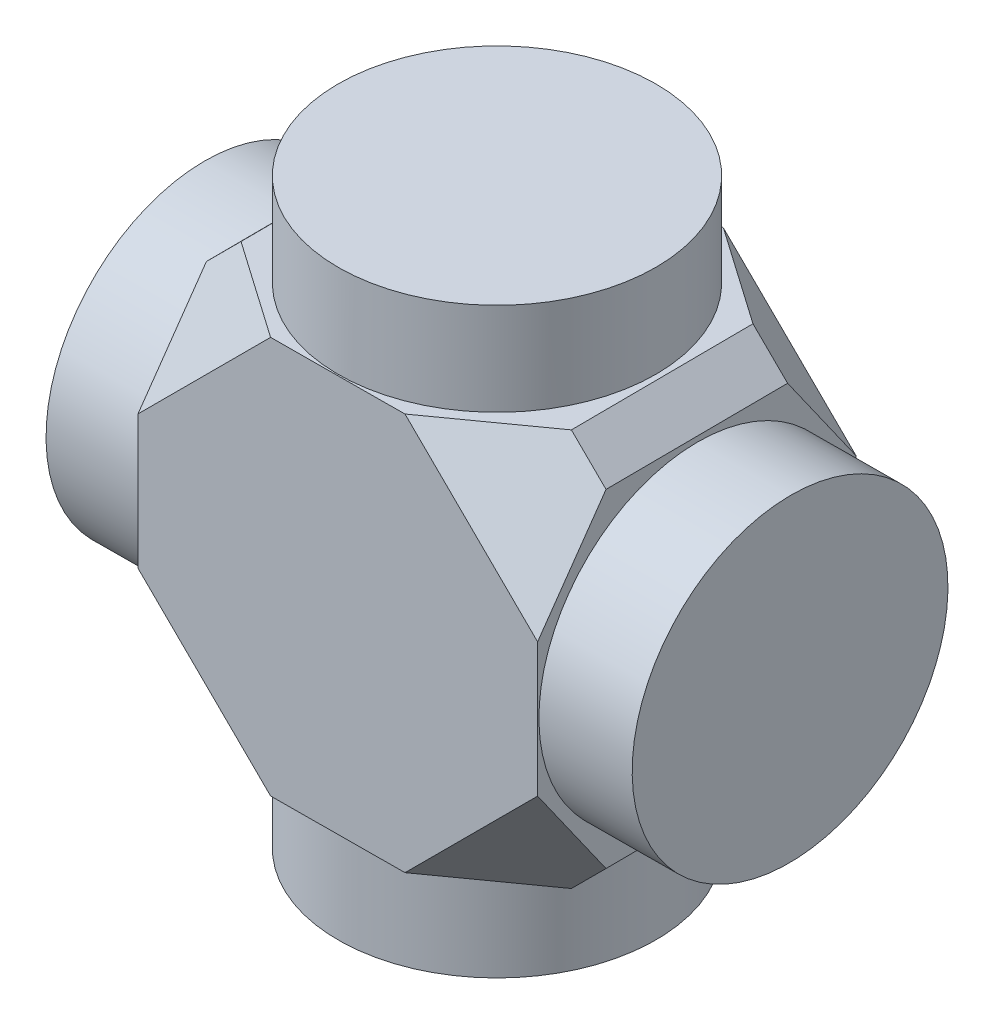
ISO-10303-21;
HEADER;
FILE_DESCRIPTION(('STEP AP214'),'2;1');
FILE_NAME('part.step','',(''),(''),'','','');
FILE_SCHEMA(('AUTOMOTIVE_DESIGN { 1 0 10303 214 1 1 1 1 }'));
ENDSEC;
DATA;
#1=APPLICATION_CONTEXT('core data for automotive mechanical design processes');
#2=APPLICATION_PROTOCOL_DEFINITION('international standard','automotive_design',2000,#1);
#3=PRODUCT_CONTEXT('',#1,'mechanical');
#4=PRODUCT('Part','Part','',(#3));
#5=PRODUCT_RELATED_PRODUCT_CATEGORY('part','',(#4));
#6=PRODUCT_DEFINITION_FORMATION('','',#4);
#7=PRODUCT_DEFINITION_CONTEXT('part definition',#1,'design');
#8=PRODUCT_DEFINITION('design','',#6,#7);
#9=PRODUCT_DEFINITION_SHAPE('','',#8);
#10=(LENGTH_UNIT() NAMED_UNIT(*) SI_UNIT(.MILLI.,.METRE.));
#11=(NAMED_UNIT(*) PLANE_ANGLE_UNIT() SI_UNIT($,.RADIAN.));
#12=(NAMED_UNIT(*) SI_UNIT($,.STERADIAN.) SOLID_ANGLE_UNIT());
#13=UNCERTAINTY_MEASURE_WITH_UNIT(LENGTH_MEASURE(1.E-05),#10,'distance_accuracy_value','');
#14=(GEOMETRIC_REPRESENTATION_CONTEXT(3) GLOBAL_UNCERTAINTY_ASSIGNED_CONTEXT((#13)) GLOBAL_UNIT_ASSIGNED_CONTEXT((#10,
#11,#12)) REPRESENTATION_CONTEXT('',''));
#15=CARTESIAN_POINT('',(0.,0.,0.));
#16=DIRECTION('',(0.,0.,1.));
#17=DIRECTION('',(1.,0.,0.));
#18=AXIS2_PLACEMENT_3D('',#15,#16,#17);
#19=CARTESIAN_POINT('',(-75.000000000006,10.9999999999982,-148.379999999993));
#20=DIRECTION('',(0.,-1.,0.));
#21=DIRECTION('',(0.999980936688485,0.,-0.00617464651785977));
#22=AXIS2_PLACEMENT_3D('',#19,#20,#21);
#23=CYLINDRICAL_SURFACE('',#22,6.);
#24=CARTESIAN_POINT('',(-75.000000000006,10.9999999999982,-148.379999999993));
#25=DIRECTION('',(0.,1.,0.));
#26=DIRECTION('',(-0.999980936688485,0.,0.00617464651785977));
#27=AXIS2_PLACEMENT_3D('',#24,#25,#26);
#28=CIRCLE('',#27,6.);
#29=CARTESIAN_POINT('',(-80.9998856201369,10.9999999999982,-148.342952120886));
#30=VERTEX_POINT('',#29);
#31=EDGE_CURVE('E264',#30,#30,#28,.T.);
#32=ORIENTED_EDGE('',*,*,#31,.F.);
#33=EDGE_LOOP('',(#32));
#34=FACE_BOUND('',#33,.T.);
#35=CARTESIAN_POINT('',(-75.000000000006,7.49999999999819,-148.379999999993));
#36=DIRECTION('',(0.,-1.,0.));
#37=DIRECTION('',(0.999980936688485,0.,-0.00617464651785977));
#38=AXIS2_PLACEMENT_3D('',#35,#36,#37);
#39=CIRCLE('',#38,6.);
#40=CARTESIAN_POINT('',(-69.0001143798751,7.49999999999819,-148.4170478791));
#41=VERTEX_POINT('',#40);
#42=EDGE_CURVE('E20',#41,#41,#39,.F.);
#43=ORIENTED_EDGE('',*,*,#42,.T.);
#44=EDGE_LOOP('',(#43));
#45=FACE_BOUND('',#44,.T.);
#46=ADVANCED_FACE('F16',(#34,#45),#23,.T.);
#47=CARTESIAN_POINT('',(-75.000000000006,10.9999999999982,-148.379999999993));
#48=DIRECTION('',(0.,1.,0.));
#49=DIRECTION('',(-0.999980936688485,0.,0.00617464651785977));
#50=AXIS2_PLACEMENT_3D('',#47,#48,#49);
#51=PLANE('',#50);
#52=ORIENTED_EDGE('',*,*,#31,.T.);
#53=EDGE_LOOP('',(#52));
#54=FACE_BOUND('',#53,.T.);
#55=ADVANCED_FACE('F344',(#54),#51,.T.);
#56=CARTESIAN_POINT('',(-64.0002096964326,-1.81256351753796E-12,-148.44792111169));
#57=DIRECTION('',(0.999980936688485,0.,-0.00617464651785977));
#58=DIRECTION('',(0.,1.,0.));
#59=AXIS2_PLACEMENT_3D('',#56,#57,#58);
#60=PLANE('',#59);
#61=CARTESIAN_POINT('',(-64.0002096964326,-1.81256351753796E-12,-148.44792111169));
#62=DIRECTION('',(0.999980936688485,0.,-0.00617464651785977));
#63=DIRECTION('',(0.,1.,0.));
#64=AXIS2_PLACEMENT_3D('',#61,#62,#63);
#65=CIRCLE('',#64,6.);
#66=CARTESIAN_POINT('',(-64.0002096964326,5.99999999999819,-148.44792111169));
#67=VERTEX_POINT('',#66);
#68=EDGE_CURVE('E252',#67,#67,#65,.T.);
#69=ORIENTED_EDGE('',*,*,#68,.T.);
#70=EDGE_LOOP('',(#69));
#71=FACE_BOUND('',#70,.T.);
#72=ADVANCED_FACE('F352',(#71),#60,.T.);
#73=CARTESIAN_POINT('',(-85.9997903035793,-1.81444636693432E-12,-148.312078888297));
#74=DIRECTION('',(0.999980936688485,0.,-0.00617464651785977));
#75=DIRECTION('',(0.,1.,0.));
#76=AXIS2_PLACEMENT_3D('',#73,#74,#75);
#77=PLANE('',#76);
#78=CARTESIAN_POINT('',(-85.9997903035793,-1.81444636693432E-12,-148.312078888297));
#79=DIRECTION('',(0.999980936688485,0.,-0.00617464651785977));
#80=DIRECTION('',(0.,1.,0.));
#81=AXIS2_PLACEMENT_3D('',#78,#79,#80);
#82=CIRCLE('',#81,6.);
#83=CARTESIAN_POINT('',(-85.9997903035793,5.99999999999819,-148.312078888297));
#84=VERTEX_POINT('',#83);
#85=EDGE_CURVE('E259',#84,#84,#82,.T.);
#86=ORIENTED_EDGE('',*,*,#85,.F.);
#87=EDGE_LOOP('',(#86));
#88=FACE_BOUND('',#87,.T.);
#89=ADVANCED_FACE('F514',(#88),#77,.F.);
#90=CARTESIAN_POINT('',(-64.0002096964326,-1.81256351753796E-12,-148.44792111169));
#91=DIRECTION('',(-0.999980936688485,0.,0.00617464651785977));
#92=DIRECTION('',(0.,-1.,0.));
#93=AXIS2_PLACEMENT_3D('',#90,#91,#92);
#94=CYLINDRICAL_SURFACE('',#93,6.);
#95=CARTESIAN_POINT('',(-67.5001429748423,-1.81286306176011E-12,-148.426309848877));
#96=DIRECTION('',(0.999980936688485,0.,-0.00617464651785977));
#97=DIRECTION('',(0.,1.,0.));
#98=AXIS2_PLACEMENT_3D('',#95,#96,#97);
#99=CIRCLE('',#98,6.);
#100=CARTESIAN_POINT('',(-67.5001429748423,5.99999999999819,-148.426309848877));
#101=VERTEX_POINT('',#100);
#102=EDGE_CURVE('E249',#101,#101,#99,.F.);
#103=ORIENTED_EDGE('',*,*,#102,.F.);
#104=EDGE_LOOP('',(#103));
#105=FACE_BOUND('',#104,.T.);
#106=ORIENTED_EDGE('',*,*,#68,.F.);
#107=EDGE_LOOP('',(#106));
#108=FACE_BOUND('',#107,.T.);
#109=ADVANCED_FACE('F520',(#105,#108),#94,.T.);
#110=ORIENTED_EDGE('',*,*,#85,.T.);
#111=EDGE_LOOP('',(#110));
#112=FACE_BOUND('',#111,.T.);
#113=CARTESIAN_POINT('',(-82.4998570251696,-1.81414682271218E-12,-148.333690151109));
#114=DIRECTION('',(0.999980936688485,0.,-0.00617464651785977));
#115=DIRECTION('',(0.,1.,0.));
#116=AXIS2_PLACEMENT_3D('',#113,#114,#115);
#117=CIRCLE('',#116,6.);
#118=CARTESIAN_POINT('',(-82.4998570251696,5.99999999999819,-148.333690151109));
#119=VERTEX_POINT('',#118);
#120=EDGE_CURVE('E248',#119,#119,#117,.F.);
#121=ORIENTED_EDGE('',*,*,#120,.T.);
#122=EDGE_LOOP('',(#121));
#123=FACE_BOUND('',#122,.T.);
#124=ADVANCED_FACE('F529',(#112,#123),#94,.T.);
#125=CARTESIAN_POINT('',(-67.4627863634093,-7.50000000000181,-142.376425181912));
#126=DIRECTION('',(0.999980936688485,0.,-0.00617464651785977));
#127=DIRECTION('',(0.,1.,0.));
#128=AXIS2_PLACEMENT_3D('',#125,#126,#127);
#129=PLANE('',#128);
#130=ORIENTED_EDGE('',*,*,#102,.T.);
#131=EDGE_LOOP('',(#130));
#132=FACE_BOUND('',#131,.T.);
#133=DIRECTION('',(-0.00617464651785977,0.,-0.999980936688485));
#134=VECTOR('',#133,1.);
#135=CARTESIAN_POINT('',(-67.5374995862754,-6.20000000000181,-154.476194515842));
#136=LINE('',#135,#134);
#137=CARTESIAN_POINT('',(-67.4788404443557,-6.20000000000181,-144.976375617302));
#138=VERTEX_POINT('',#137);
#139=CARTESIAN_POINT('',(-67.5214455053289,-6.20000000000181,-151.876244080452));
#140=VERTEX_POINT('',#139);
#141=EDGE_CURVE('E182',#138,#140,#136,.T.);
#142=ORIENTED_EDGE('',*,*,#141,.T.);
#143=DIRECTION('',(-0.0035649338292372,0.816496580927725,-0.577339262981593));
#144=VECTOR('',#143,1.);
#145=CARTESIAN_POINT('',(-67.4981084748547,-11.5450096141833,-148.096823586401));
#146=LINE('',#145,#144);
#147=CARTESIAN_POINT('',(-67.5374995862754,-2.52304473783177,-154.476194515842));
#148=VERTEX_POINT('',#147);
#149=EDGE_CURVE('E232',#140,#148,#146,.T.);
#150=ORIENTED_EDGE('',*,*,#149,.T.);
#151=DIRECTION('',(0.,1.,0.));
#152=VECTOR('',#151,1.);
#153=CARTESIAN_POINT('',(-67.5374995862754,-7.50000000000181,-154.476194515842));
#154=LINE('',#153,#152);
#155=CARTESIAN_POINT('',(-67.5374995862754,2.52304473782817,-154.476194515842));
#156=VERTEX_POINT('',#155);
#157=EDGE_CURVE('E153',#148,#156,#154,.T.);
#158=ORIENTED_EDGE('',*,*,#157,.T.);
#159=DIRECTION('',(0.00356493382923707,0.816496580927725,0.577339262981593));
#160=VECTOR('',#159,1.);
#161=CARTESIAN_POINT('',(-67.5417698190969,1.54500961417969,-155.167756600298));
#162=LINE('',#161,#160);
#163=CARTESIAN_POINT('',(-67.5214455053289,6.19999999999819,-151.876244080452));
#164=VERTEX_POINT('',#163);
#165=EDGE_CURVE('E39',#156,#164,#162,.T.);
#166=ORIENTED_EDGE('',*,*,#165,.T.);
#167=DIRECTION('',(0.00617464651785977,0.,0.999980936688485));
#168=VECTOR('',#167,1.);
#169=CARTESIAN_POINT('',(-67.4627863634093,6.19999999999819,-142.376425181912));
#170=LINE('',#169,#168);
#171=CARTESIAN_POINT('',(-67.4788404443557,6.19999999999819,-144.976375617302));
#172=VERTEX_POINT('',#171);
#173=EDGE_CURVE('E180',#164,#172,#170,.T.);
#174=ORIENTED_EDGE('',*,*,#173,.T.);
#175=DIRECTION('',(0.00356493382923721,-0.816496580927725,0.577339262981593));
#176=VECTOR('',#175,1.);
#177=CARTESIAN_POINT('',(-67.4336117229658,-4.15898508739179,-137.651606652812));
#178=LINE('',#177,#176);
#179=CARTESIAN_POINT('',(-67.4627863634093,2.52304473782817,-142.376425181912));
#180=VERTEX_POINT('',#179);
#181=EDGE_CURVE('E227',#172,#180,#178,.T.);
#182=ORIENTED_EDGE('',*,*,#181,.T.);
#183=DIRECTION('',(0.,-1.,0.));
#184=VECTOR('',#183,1.);
#185=CARTESIAN_POINT('',(-67.4627863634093,7.49999999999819,-142.376425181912));
#186=LINE('',#185,#184);
#187=CARTESIAN_POINT('',(-67.4627863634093,-2.52304473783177,-142.376425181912));
#188=VERTEX_POINT('',#187);
#189=EDGE_CURVE('E271',#180,#188,#186,.T.);
#190=ORIENTED_EDGE('',*,*,#189,.T.);
#191=DIRECTION('',(-0.00356493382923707,-0.816496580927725,-0.577339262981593));
#192=VECTOR('',#191,1.);
#193=CARTESIAN_POINT('',(-67.4772730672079,-5.84101491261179,-144.72253966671));
#194=LINE('',#193,#192);
#195=EDGE_CURVE('E229',#188,#138,#194,.T.);
#196=ORIENTED_EDGE('',*,*,#195,.T.);
#197=EDGE_LOOP('',(#142,#150,#158,#166,#174,#182,#190,#196));
#198=FACE_BOUND('',#197,.T.);
#199=ADVANCED_FACE('F318',(#132,#198),#129,.T.);
#200=CARTESIAN_POINT('',(-82.4625004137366,-7.50000000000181,-142.283805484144));
#201=DIRECTION('',(0.999980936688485,0.,-0.00617464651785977));
#202=DIRECTION('',(0.,1.,0.));
#203=AXIS2_PLACEMENT_3D('',#200,#201,#202);
#204=PLANE('',#203);
#205=ORIENTED_EDGE('',*,*,#120,.F.);
#206=EDGE_LOOP('',(#205));
#207=FACE_BOUND('',#206,.T.);
#208=DIRECTION('',(-0.00617464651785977,0.,-0.999980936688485));
#209=VECTOR('',#208,1.);
#210=CARTESIAN_POINT('',(-82.4625004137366,6.19999999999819,-142.283805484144));
#211=LINE('',#210,#209);
#212=CARTESIAN_POINT('',(-82.478554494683,6.19999999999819,-144.883755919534));
#213=VERTEX_POINT('',#212);
#214=CARTESIAN_POINT('',(-82.5211595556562,6.19999999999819,-151.783624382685));
#215=VERTEX_POINT('',#214);
#216=EDGE_CURVE('E174',#213,#215,#211,.T.);
#217=ORIENTED_EDGE('',*,*,#216,.T.);
#218=DIRECTION('',(0.00356493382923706,0.816496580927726,0.577339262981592));
#219=VECTOR('',#218,1.);
#220=CARTESIAN_POINT('',(-82.5299702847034,4.18202982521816,-153.210517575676));
#221=LINE('',#220,#219);
#222=CARTESIAN_POINT('',(-82.5372136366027,2.52304473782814,-154.383574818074));
#223=VERTEX_POINT('',#222);
#224=EDGE_CURVE('E214',#215,#223,#221,.F.);
#225=ORIENTED_EDGE('',*,*,#224,.T.);
#226=DIRECTION('',(0.,1.,0.));
#227=VECTOR('',#226,1.);
#228=CARTESIAN_POINT('',(-82.5372136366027,-7.50000000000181,-154.383574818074));
#229=LINE('',#228,#227);
#230=CARTESIAN_POINT('',(-82.5372136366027,-2.52304473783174,-154.383574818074));
#231=VERTEX_POINT('',#230);
#232=EDGE_CURVE('E256',#231,#223,#229,.T.);
#233=ORIENTED_EDGE('',*,*,#232,.F.);
#234=DIRECTION('',(-0.0035649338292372,0.816496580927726,-0.577339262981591));
#235=VECTOR('',#234,1.);
#236=CARTESIAN_POINT('',(-82.5081396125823,-9.18202982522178,-149.675051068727));
#237=LINE('',#236,#235);
#238=CARTESIAN_POINT('',(-82.5211595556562,-6.2000000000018,-151.783624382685));
#239=VERTEX_POINT('',#238);
#240=EDGE_CURVE('E212',#231,#239,#237,.F.);
#241=ORIENTED_EDGE('',*,*,#240,.T.);
#242=DIRECTION('',(0.00617464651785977,0.,0.999980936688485));
#243=VECTOR('',#242,1.);
#244=CARTESIAN_POINT('',(-82.4625004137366,-6.2000000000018,-142.283805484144));
#245=LINE('',#244,#243);
#246=CARTESIAN_POINT('',(-82.478554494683,-6.2000000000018,-144.883755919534));
#247=VERTEX_POINT('',#246);
#248=EDGE_CURVE('E177',#239,#247,#245,.T.);
#249=ORIENTED_EDGE('',*,*,#248,.T.);
#250=DIRECTION('',(-0.00356493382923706,-0.816496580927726,-0.577339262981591));
#251=VECTOR('',#250,1.);
#252=CARTESIAN_POINT('',(-82.4697437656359,-4.18202982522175,-143.456862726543));
#253=LINE('',#252,#251);
#254=CARTESIAN_POINT('',(-82.4625004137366,-2.52304473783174,-142.283805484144));
#255=VERTEX_POINT('',#254);
#256=EDGE_CURVE('E210',#247,#255,#253,.F.);
#257=ORIENTED_EDGE('',*,*,#256,.T.);
#258=DIRECTION('',(0.,-1.,0.));
#259=VECTOR('',#258,1.);
#260=CARTESIAN_POINT('',(-82.4625004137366,7.49999999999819,-142.283805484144));
#261=LINE('',#260,#259);
#262=CARTESIAN_POINT('',(-82.4625004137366,2.52304473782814,-142.283805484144));
#263=VERTEX_POINT('',#262);
#264=EDGE_CURVE('E251',#263,#255,#261,.T.);
#265=ORIENTED_EDGE('',*,*,#264,.F.);
#266=DIRECTION('',(0.0035649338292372,-0.816496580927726,0.577339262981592));
#267=VECTOR('',#266,1.);
#268=CARTESIAN_POINT('',(-82.4915744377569,9.18202982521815,-146.992329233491));
#269=LINE('',#268,#267);
#270=EDGE_CURVE('E208',#263,#213,#269,.F.);
#271=ORIENTED_EDGE('',*,*,#270,.T.);
#272=EDGE_LOOP('',(#217,#225,#233,#241,#249,#257,#265,#271));
#273=FACE_BOUND('',#272,.T.);
#274=ADVANCED_FACE('F290',(#207,#273),#204,.F.);
#275=CARTESIAN_POINT('',(-79.9740702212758,-5.01152236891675,-142.299170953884));
#276=DIRECTION('',(0.495624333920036,0.5,-0.710180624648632));
#277=DIRECTION('',(0.707093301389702,-0.70710678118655,-0.00436613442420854));
#278=AXIS2_PLACEMENT_3D('',#275,#276,#277);
#279=PLANE('',#278);
#280=ORIENTED_EDGE('',*,*,#256,.F.);
#281=DIRECTION('',(0.707093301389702,-0.70710678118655,-0.00436613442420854));
#282=VECTOR('',#281,1.);
#283=CARTESIAN_POINT('',(-82.478554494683,-6.2000000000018,-144.883755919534));
#284=LINE('',#283,#282);
#285=CARTESIAN_POINT('',(-81.178579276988,-7.50000000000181,-144.891782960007));
#286=VERTEX_POINT('',#285);
#287=EDGE_CURVE('E216',#286,#247,#284,.F.);
#288=ORIENTED_EDGE('',*,*,#287,.F.);
#289=DIRECTION('',(0.820045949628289,0.,0.572297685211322));
#290=VECTOR('',#289,1.);
#291=CARTESIAN_POINT('',(-79.1518368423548,-7.50000000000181,-143.477350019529));
#292=LINE('',#291,#290);
#293=CARTESIAN_POINT('',(-77.4856400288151,-7.50000000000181,-142.314536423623));
#294=VERTEX_POINT('',#293);
#295=EDGE_CURVE('E220',#294,#286,#292,.F.);
#296=ORIENTED_EDGE('',*,*,#295,.F.);
#297=DIRECTION('',(0.707093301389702,-0.70710678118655,-0.00436613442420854));
#298=VECTOR('',#297,1.);
#299=CARTESIAN_POINT('',(-79.3240826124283,-5.66152236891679,-142.30318447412));
#300=LINE('',#299,#298);
#301=EDGE_CURVE('E243',#255,#294,#300,.T.);
#302=ORIENTED_EDGE('',*,*,#301,.F.);
#303=EDGE_LOOP('',(#280,#288,#296,#302));
#304=FACE_BOUND('',#303,.T.);
#305=ADVANCED_FACE('F311',(#304),#279,.F.);
#306=CARTESIAN_POINT('',(-62.4513595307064,2.48847763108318,-142.407369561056));
#307=DIRECTION('',(0.50435660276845,-0.5,0.704005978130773));
#308=DIRECTION('',(-0.707093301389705,-0.707106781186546,0.00436613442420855));
#309=AXIS2_PLACEMENT_3D('',#306,#307,#308);
#310=PLANE('',#309);
#311=DIRECTION('',(-0.812916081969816,0.,0.58238084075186));
#312=VECTOR('',#311,1.);
#313=CARTESIAN_POINT('',(-65.8098626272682,-7.50000000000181,-147.095334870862));
#314=LINE('',#313,#312);
#315=CARTESIAN_POINT('',(-68.7788156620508,-7.50000000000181,-144.968348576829));
#316=VERTEX_POINT('',#315);
#317=CARTESIAN_POINT('',(-72.4396467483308,-7.50000000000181,-142.345694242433));
#318=VERTEX_POINT('',#317);
#319=EDGE_CURVE('E142',#316,#318,#314,.T.);
#320=ORIENTED_EDGE('',*,*,#319,.F.);
#321=DIRECTION('',(-0.707093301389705,-0.707106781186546,0.00436613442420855));
#322=VECTOR('',#321,1.);
#323=CARTESIAN_POINT('',(-68.7788156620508,-7.50000000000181,-144.968348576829));
#324=LINE('',#323,#322);
#325=EDGE_CURVE('E224',#138,#316,#324,.T.);
#326=ORIENTED_EDGE('',*,*,#325,.F.);
#327=ORIENTED_EDGE('',*,*,#195,.F.);
#328=DIRECTION('',(0.707093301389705,0.707106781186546,-0.00436613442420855));
#329=VECTOR('',#328,1.);
#330=CARTESIAN_POINT('',(-69.3012289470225,-4.36152236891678,-142.365073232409));
#331=LINE('',#330,#329);
#332=EDGE_CURVE('E246',#318,#188,#331,.T.);
#333=ORIENTED_EDGE('',*,*,#332,.F.);
#334=EDGE_LOOP('',(#320,#326,#327,#333));
#335=FACE_BOUND('',#334,.T.);
#336=ADVANCED_FACE('F317',(#335),#310,.T.);
#337=CARTESIAN_POINT('',(-67.4627863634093,-6.20000000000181,-142.376425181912));
#338=DIRECTION('',(0.707093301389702,-0.707106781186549,-0.00436613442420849));
#339=DIRECTION('',(0.00617464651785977,0.,0.999980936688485));
#340=AXIS2_PLACEMENT_3D('',#337,#338,#339);
#341=PLANE('',#340);
#342=DIRECTION('',(0.00617464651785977,0.,0.999980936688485));
#343=VECTOR('',#342,1.);
#344=CARTESIAN_POINT('',(-68.7627615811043,-7.50000000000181,-142.368398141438));
#345=LINE('',#344,#343);
#346=CARTESIAN_POINT('',(-68.821420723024,-7.50000000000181,-151.868217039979));
#347=VERTEX_POINT('',#346);
#348=EDGE_CURVE('E164',#347,#316,#345,.T.);
#349=ORIENTED_EDGE('',*,*,#348,.F.);
#350=DIRECTION('',(0.707093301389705,0.707106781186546,-0.00436613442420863));
#351=VECTOR('',#350,1.);
#352=CARTESIAN_POINT('',(-67.5214455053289,-6.20000000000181,-151.876244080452));
#353=LINE('',#352,#351);
#354=EDGE_CURVE('E136',#347,#140,#353,.T.);
#355=ORIENTED_EDGE('',*,*,#354,.T.);
#356=ORIENTED_EDGE('',*,*,#141,.F.);
#357=ORIENTED_EDGE('',*,*,#325,.T.);
#358=EDGE_LOOP('',(#349,#355,#356,#357));
#359=FACE_BOUND('',#358,.T.);
#360=ADVANCED_FACE('F330',(#359),#341,.T.);
#361=CARTESIAN_POINT('',(-70.0259297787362,-5.01152236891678,-154.460829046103));
#362=DIRECTION('',(0.495624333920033,-0.5,-0.710180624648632));
#363=DIRECTION('',(0.707093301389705,0.707106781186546,-0.00436613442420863));
#364=AXIS2_PLACEMENT_3D('',#361,#362,#363);
#365=PLANE('',#364);
#366=ORIENTED_EDGE('',*,*,#149,.F.);
#367=ORIENTED_EDGE('',*,*,#354,.F.);
#368=DIRECTION('',(0.820045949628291,0.,0.57229768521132));
#369=VECTOR('',#368,1.);
#370=CARTESIAN_POINT('',(-70.8481631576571,-7.50000000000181,-153.282649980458));
#371=LINE('',#370,#369);
#372=CARTESIAN_POINT('',(-72.5143599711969,-7.50000000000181,-154.445463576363));
#373=VERTEX_POINT('',#372);
#374=EDGE_CURVE('E131',#373,#347,#371,.T.);
#375=ORIENTED_EDGE('',*,*,#374,.F.);
#376=DIRECTION('',(-0.707093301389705,-0.707106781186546,0.00436613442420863));
#377=VECTOR('',#376,1.);
#378=CARTESIAN_POINT('',(-70.6759173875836,-5.66152236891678,-154.456815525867));
#379=LINE('',#378,#377);
#380=EDGE_CURVE('E135',#148,#373,#379,.T.);
#381=ORIENTED_EDGE('',*,*,#380,.F.);
#382=EDGE_LOOP('',(#366,#367,#375,#381));
#383=FACE_BOUND('',#382,.T.);
#384=ADVANCED_FACE('F134',(#383),#365,.T.);
#385=CARTESIAN_POINT('',(-72.5489264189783,-12.5115223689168,-154.445250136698));
#386=DIRECTION('',(0.504356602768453,0.5,0.704005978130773));
#387=DIRECTION('',(-0.707093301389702,0.70710678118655,0.00436613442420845));
#388=AXIS2_PLACEMENT_3D('',#385,#386,#387);
#389=PLANE('',#388);
#390=DIRECTION('',(-0.812916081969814,0.,0.582380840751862));
#391=VECTOR('',#390,1.);
#392=CARTESIAN_POINT('',(-74.233989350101,-7.50000000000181,-156.797344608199));
#393=LINE('',#392,#391);
#394=CARTESIAN_POINT('',(-81.2211843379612,-7.50000000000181,-151.791651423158));
#395=VERTEX_POINT('',#394);
#396=CARTESIAN_POINT('',(-77.5603532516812,-7.50000000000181,-154.414305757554));
#397=VERTEX_POINT('',#396);
#398=EDGE_CURVE('E141',#395,#397,#393,.F.);
#399=ORIENTED_EDGE('',*,*,#398,.F.);
#400=DIRECTION('',(-0.707093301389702,0.70710678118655,0.00436613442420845));
#401=VECTOR('',#400,1.);
#402=CARTESIAN_POINT('',(-81.2211843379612,-7.50000000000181,-151.791651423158));
#403=LINE('',#402,#401);
#404=EDGE_CURVE('E218',#239,#395,#403,.F.);
#405=ORIENTED_EDGE('',*,*,#404,.F.);
#406=ORIENTED_EDGE('',*,*,#240,.F.);
#407=DIRECTION('',(-0.707093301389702,0.70710678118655,0.00436613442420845));
#408=VECTOR('',#407,1.);
#409=CARTESIAN_POINT('',(-80.6987710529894,-4.36152236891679,-154.394926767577));
#410=LINE('',#409,#408);
#411=EDGE_CURVE('E154',#397,#231,#410,.T.);
#412=ORIENTED_EDGE('',*,*,#411,.F.);
#413=EDGE_LOOP('',(#399,#405,#406,#412));
#414=FACE_BOUND('',#413,.T.);
#415=ADVANCED_FACE('F302',(#414),#389,.F.);
#416=CARTESIAN_POINT('',(-81.1625251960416,-7.50000000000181,-142.291832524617));
#417=DIRECTION('',(0.707093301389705,0.707106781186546,-0.00436613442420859));
#418=DIRECTION('',(-0.00617464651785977,0.,-0.999980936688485));
#419=AXIS2_PLACEMENT_3D('',#416,#417,#418);
#420=PLANE('',#419);
#421=ORIENTED_EDGE('',*,*,#248,.F.);
#422=ORIENTED_EDGE('',*,*,#404,.T.);
#423=DIRECTION('',(-0.00617464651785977,0.,-0.999980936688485));
#424=VECTOR('',#423,1.);
#425=CARTESIAN_POINT('',(-81.1625251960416,-7.50000000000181,-142.291832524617));
#426=LINE('',#425,#424);
#427=EDGE_CURVE('E172',#286,#395,#426,.T.);
#428=ORIENTED_EDGE('',*,*,#427,.F.);
#429=ORIENTED_EDGE('',*,*,#287,.T.);
#430=EDGE_LOOP('',(#421,#422,#428,#429));
#431=FACE_BOUND('',#430,.T.);
#432=ADVANCED_FACE('F307',(#431),#420,.F.);
#433=CARTESIAN_POINT('',(-62.5260727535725,-2.48847763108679,-154.507138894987));
#434=DIRECTION('',(0.495624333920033,0.5,-0.710180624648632));
#435=DIRECTION('',(-0.707093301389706,0.707106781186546,0.00436613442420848));
#436=AXIS2_PLACEMENT_3D('',#433,#434,#435);
#437=PLANE('',#436);
#438=DIRECTION('',(-0.82004594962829,0.,-0.572297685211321));
#439=VECTOR('',#438,1.);
#440=CARTESIAN_POINT('',(-65.8264278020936,7.49999999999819,-149.778056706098));
#441=LINE('',#440,#439);
#442=CARTESIAN_POINT('',(-68.8214207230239,7.49999999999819,-151.868217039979));
#443=VERTEX_POINT('',#442);
#444=CARTESIAN_POINT('',(-72.5143599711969,7.49999999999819,-154.445463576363));
#445=VERTEX_POINT('',#444);
#446=EDGE_CURVE('E200',#443,#445,#441,.T.);
#447=ORIENTED_EDGE('',*,*,#446,.F.);
#448=DIRECTION('',(-0.707093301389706,0.707106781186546,0.00436613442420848));
#449=VECTOR('',#448,1.);
#450=CARTESIAN_POINT('',(-68.8214207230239,7.49999999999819,-151.868217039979));
#451=LINE('',#450,#449);
#452=EDGE_CURVE('E235',#164,#443,#451,.T.);
#453=ORIENTED_EDGE('',*,*,#452,.F.);
#454=ORIENTED_EDGE('',*,*,#165,.F.);
#455=DIRECTION('',(0.707093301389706,-0.707106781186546,-0.00436613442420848));
#456=VECTOR('',#455,1.);
#457=CARTESIAN_POINT('',(-69.3759421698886,4.36152236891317,-154.464842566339));
#458=LINE('',#457,#456);
#459=EDGE_CURVE('E155',#445,#156,#458,.T.);
#460=ORIENTED_EDGE('',*,*,#459,.F.);
#461=EDGE_LOOP('',(#447,#453,#454,#460));
#462=FACE_BOUND('',#461,.T.);
#463=ADVANCED_FACE('F327',(#462),#437,.T.);
#464=CARTESIAN_POINT('',(-67.4627863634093,6.19999999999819,-142.376425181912));
#465=DIRECTION('',(0.707093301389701,0.707106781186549,-0.00436613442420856));
#466=DIRECTION('',(-0.00617464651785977,0.,-0.999980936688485));
#467=AXIS2_PLACEMENT_3D('',#464,#465,#466);
#468=PLANE('',#467);
#469=ORIENTED_EDGE('',*,*,#173,.F.);
#470=ORIENTED_EDGE('',*,*,#452,.T.);
#471=DIRECTION('',(-0.00617464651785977,0.,-0.999980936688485));
#472=VECTOR('',#471,1.);
#473=CARTESIAN_POINT('',(-68.8374748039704,7.49999999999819,-154.468167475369));
#474=LINE('',#473,#472);
#475=CARTESIAN_POINT('',(-68.7788156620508,7.49999999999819,-144.968348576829));
#476=VERTEX_POINT('',#475);
#477=EDGE_CURVE('E185',#476,#443,#474,.T.);
#478=ORIENTED_EDGE('',*,*,#477,.F.);
#479=DIRECTION('',(0.707093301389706,-0.707106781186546,-0.00436613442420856));
#480=VECTOR('',#479,1.);
#481=CARTESIAN_POINT('',(-67.4788404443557,6.19999999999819,-144.976375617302));
#482=LINE('',#481,#480);
#483=EDGE_CURVE('E32',#476,#172,#482,.T.);
#484=ORIENTED_EDGE('',*,*,#483,.T.);
#485=EDGE_LOOP('',(#469,#470,#478,#484));
#486=FACE_BOUND('',#485,.T.);
#487=ADVANCED_FACE('F324',(#486),#468,.T.);
#488=CARTESIAN_POINT('',(-69.95121655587,5.01152236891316,-142.361059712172));
#489=DIRECTION('',(0.504356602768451,0.5,0.704005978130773));
#490=DIRECTION('',(0.707093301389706,-0.707106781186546,-0.00436613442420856));
#491=AXIS2_PLACEMENT_3D('',#488,#489,#490);
#492=PLANE('',#491);
#493=ORIENTED_EDGE('',*,*,#181,.F.);
#494=ORIENTED_EDGE('',*,*,#483,.F.);
#495=DIRECTION('',(0.812916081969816,0.,-0.582380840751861));
#496=VECTOR('',#495,1.);
#497=CARTESIAN_POINT('',(-70.7879366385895,7.49999999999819,-143.528995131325));
#498=LINE('',#497,#496);
#499=CARTESIAN_POINT('',(-72.4396467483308,7.49999999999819,-142.345694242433));
#500=VERTEX_POINT('',#499);
#501=EDGE_CURVE('E196',#500,#476,#498,.T.);
#502=ORIENTED_EDGE('',*,*,#501,.F.);
#503=DIRECTION('',(-0.707093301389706,0.707106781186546,0.00436613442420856));
#504=VECTOR('',#503,1.);
#505=CARTESIAN_POINT('',(-70.6012041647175,5.66152236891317,-142.357046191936));
#506=LINE('',#505,#504);
#507=EDGE_CURVE('E237',#180,#500,#506,.T.);
#508=ORIENTED_EDGE('',*,*,#507,.F.);
#509=EDGE_LOOP('',(#493,#494,#502,#508));
#510=FACE_BOUND('',#509,.T.);
#511=ADVANCED_FACE('F18',(#510),#492,.T.);
#512=CARTESIAN_POINT('',(-67.4627863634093,7.49999999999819,-142.376425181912));
#513=DIRECTION('',(-0.00617464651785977,0.,-0.999980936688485));
#514=DIRECTION('',(0.,1.,0.));
#515=AXIS2_PLACEMENT_3D('',#512,#513,#514);
#516=PLANE('',#515);
#517=DIRECTION('',(-0.999980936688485,0.,0.00617464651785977));
#518=VECTOR('',#517,1.);
#519=CARTESIAN_POINT('',(-67.4627863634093,-7.50000000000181,-142.376425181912));
#520=LINE('',#519,#518);
#521=EDGE_CURVE('E160',#318,#294,#520,.T.);
#522=ORIENTED_EDGE('',*,*,#521,.F.);
#523=ORIENTED_EDGE('',*,*,#332,.T.);
#524=ORIENTED_EDGE('',*,*,#189,.F.);
#525=ORIENTED_EDGE('',*,*,#507,.T.);
#526=DIRECTION('',(-0.999980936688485,0.,0.00617464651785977));
#527=VECTOR('',#526,1.);
#528=CARTESIAN_POINT('',(-67.4627863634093,7.49999999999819,-142.376425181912));
#529=LINE('',#528,#527);
#530=CARTESIAN_POINT('',(-77.4856400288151,7.49999999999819,-142.314536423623));
#531=VERTEX_POINT('',#530);
#532=EDGE_CURVE('E167',#500,#531,#529,.T.);
#533=ORIENTED_EDGE('',*,*,#532,.T.);
#534=DIRECTION('',(-0.707093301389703,-0.707106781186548,0.00436613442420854));
#535=VECTOR('',#534,1.);
#536=CARTESIAN_POINT('',(-80.6240578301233,4.36152236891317,-142.295157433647));
#537=LINE('',#536,#535);
#538=EDGE_CURVE('E240',#531,#263,#537,.T.);
#539=ORIENTED_EDGE('',*,*,#538,.T.);
#540=ORIENTED_EDGE('',*,*,#264,.T.);
#541=ORIENTED_EDGE('',*,*,#301,.T.);
#542=EDGE_LOOP('',(#522,#523,#524,#525,#533,#539,#540,#541));
#543=FACE_BOUND('',#542,.T.);
#544=ADVANCED_FACE('F279',(#543),#516,.F.);
#545=CARTESIAN_POINT('',(-72.4742131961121,12.5115223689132,-142.345480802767));
#546=DIRECTION('',(0.495624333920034,-0.5,-0.710180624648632));
#547=DIRECTION('',(-0.707093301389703,-0.707106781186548,0.00436613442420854));
#548=AXIS2_PLACEMENT_3D('',#545,#546,#547);
#549=PLANE('',#548);
#550=DIRECTION('',(-0.82004594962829,0.,-0.572297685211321));
#551=VECTOR('',#550,1.);
#552=CARTESIAN_POINT('',(-74.1301014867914,7.49999999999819,-139.972756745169));
#553=LINE('',#552,#551);
#554=CARTESIAN_POINT('',(-81.178579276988,7.49999999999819,-144.891782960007));
#555=VERTEX_POINT('',#554);
#556=EDGE_CURVE('E198',#555,#531,#553,.F.);
#557=ORIENTED_EDGE('',*,*,#556,.F.);
#558=DIRECTION('',(-0.707093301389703,-0.707106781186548,0.00436613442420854));
#559=VECTOR('',#558,1.);
#560=CARTESIAN_POINT('',(-81.178579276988,7.49999999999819,-144.891782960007));
#561=LINE('',#560,#559);
#562=EDGE_CURVE('E204',#213,#555,#561,.F.);
#563=ORIENTED_EDGE('',*,*,#562,.F.);
#564=ORIENTED_EDGE('',*,*,#270,.F.);
#565=ORIENTED_EDGE('',*,*,#538,.F.);
#566=EDGE_LOOP('',(#557,#563,#564,#565));
#567=FACE_BOUND('',#566,.T.);
#568=ADVANCED_FACE('F286',(#567),#549,.F.);
#569=CARTESIAN_POINT('',(-81.2372384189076,7.49999999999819,-154.391601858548));
#570=DIRECTION('',(0.707093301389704,-0.707106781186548,-0.0043661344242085));
#571=DIRECTION('',(0.00617464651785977,0.,0.999980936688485));
#572=AXIS2_PLACEMENT_3D('',#569,#570,#571);
#573=PLANE('',#572);
#574=DIRECTION('',(0.00617464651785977,0.,0.999980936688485));
#575=VECTOR('',#574,1.);
#576=CARTESIAN_POINT('',(-81.2372384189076,7.49999999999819,-154.391601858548));
#577=LINE('',#576,#575);
#578=CARTESIAN_POINT('',(-81.2211843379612,7.49999999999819,-151.791651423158));
#579=VERTEX_POINT('',#578);
#580=EDGE_CURVE('E188',#579,#555,#577,.T.);
#581=ORIENTED_EDGE('',*,*,#580,.F.);
#582=DIRECTION('',(0.707093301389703,0.707106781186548,-0.00436613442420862));
#583=VECTOR('',#582,1.);
#584=CARTESIAN_POINT('',(-82.5211595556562,6.19999999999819,-151.783624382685));
#585=LINE('',#584,#583);
#586=EDGE_CURVE('E206',#579,#215,#585,.F.);
#587=ORIENTED_EDGE('',*,*,#586,.T.);
#588=ORIENTED_EDGE('',*,*,#216,.F.);
#589=ORIENTED_EDGE('',*,*,#562,.T.);
#590=EDGE_LOOP('',(#581,#587,#588,#589));
#591=FACE_BOUND('',#590,.T.);
#592=ADVANCED_FACE('F294',(#591),#573,.F.);
#593=CARTESIAN_POINT('',(-80.0487834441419,5.01152236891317,-154.398940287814));
#594=DIRECTION('',(0.504356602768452,-0.5,0.704005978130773));
#595=DIRECTION('',(0.707093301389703,0.707106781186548,-0.00436613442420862));
#596=AXIS2_PLACEMENT_3D('',#593,#594,#595);
#597=PLANE('',#596);
#598=ORIENTED_EDGE('',*,*,#224,.F.);
#599=ORIENTED_EDGE('',*,*,#586,.F.);
#600=DIRECTION('',(0.812916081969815,0.,-0.582380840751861));
#601=VECTOR('',#600,1.);
#602=CARTESIAN_POINT('',(-79.2120633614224,7.49999999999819,-153.231004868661));
#603=LINE('',#602,#601);
#604=CARTESIAN_POINT('',(-77.5603532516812,7.49999999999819,-154.414305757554));
#605=VERTEX_POINT('',#604);
#606=EDGE_CURVE('E202',#605,#579,#603,.F.);
#607=ORIENTED_EDGE('',*,*,#606,.F.);
#608=DIRECTION('',(0.707093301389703,0.707106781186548,-0.00436613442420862));
#609=VECTOR('',#608,1.);
#610=CARTESIAN_POINT('',(-79.3987958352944,5.66152236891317,-154.402953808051));
#611=LINE('',#610,#609);
#612=EDGE_CURVE('E193',#223,#605,#611,.T.);
#613=ORIENTED_EDGE('',*,*,#612,.F.);
#614=EDGE_LOOP('',(#598,#599,#607,#613));
#615=FACE_BOUND('',#614,.T.);
#616=ADVANCED_FACE('F297',(#615),#597,.F.);
#617=CARTESIAN_POINT('',(-67.4627863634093,-7.50000000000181,-142.376425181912));
#618=DIRECTION('',(0.,1.,0.));
#619=DIRECTION('',(-0.999980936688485,0.,0.00617464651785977));
#620=AXIS2_PLACEMENT_3D('',#617,#618,#619);
#621=PLANE('',#620);
#622=CARTESIAN_POINT('',(-75.000000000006,-7.50000000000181,-148.379999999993));
#623=DIRECTION('',(0.,1.,0.));
#624=DIRECTION('',(-0.999980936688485,0.,0.00617464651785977));
#625=AXIS2_PLACEMENT_3D('',#622,#623,#624);
#626=CIRCLE('',#625,6.);
#627=CARTESIAN_POINT('',(-80.9998856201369,-7.50000000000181,-148.342952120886));
#628=VERTEX_POINT('',#627);
#629=EDGE_CURVE('E10',#628,#628,#626,.F.);
#630=ORIENTED_EDGE('',*,*,#629,.F.);
#631=EDGE_LOOP('',(#630));
#632=FACE_BOUND('',#631,.T.);
#633=ORIENTED_EDGE('',*,*,#427,.T.);
#634=ORIENTED_EDGE('',*,*,#398,.T.);
#635=DIRECTION('',(-0.999980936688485,0.,0.00617464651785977));
#636=VECTOR('',#635,1.);
#637=CARTESIAN_POINT('',(-67.5374995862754,-7.50000000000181,-154.476194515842));
#638=LINE('',#637,#636);
#639=EDGE_CURVE('E150',#373,#397,#638,.T.);
#640=ORIENTED_EDGE('',*,*,#639,.F.);
#641=ORIENTED_EDGE('',*,*,#374,.T.);
#642=ORIENTED_EDGE('',*,*,#348,.T.);
#643=ORIENTED_EDGE('',*,*,#319,.T.);
#644=ORIENTED_EDGE('',*,*,#521,.T.);
#645=ORIENTED_EDGE('',*,*,#295,.T.);
#646=EDGE_LOOP('',(#633,#634,#640,#641,#642,#643,#644,#645));
#647=FACE_BOUND('',#646,.T.);
#648=ADVANCED_FACE('F158',(#632,#647),#621,.F.);
#649=CARTESIAN_POINT('',(-67.5374995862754,-7.50000000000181,-154.476194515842));
#650=DIRECTION('',(0.00617464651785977,0.,0.999980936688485));
#651=DIRECTION('',(0.,-1.,0.));
#652=AXIS2_PLACEMENT_3D('',#649,#650,#651);
#653=PLANE('',#652);
#654=ORIENTED_EDGE('',*,*,#232,.T.);
#655=ORIENTED_EDGE('',*,*,#612,.T.);
#656=DIRECTION('',(-0.999980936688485,0.,0.00617464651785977));
#657=VECTOR('',#656,1.);
#658=CARTESIAN_POINT('',(-67.5374995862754,7.49999999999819,-154.476194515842));
#659=LINE('',#658,#657);
#660=EDGE_CURVE('E161',#445,#605,#659,.T.);
#661=ORIENTED_EDGE('',*,*,#660,.F.);
#662=ORIENTED_EDGE('',*,*,#459,.T.);
#663=ORIENTED_EDGE('',*,*,#157,.F.);
#664=ORIENTED_EDGE('',*,*,#380,.T.);
#665=ORIENTED_EDGE('',*,*,#639,.T.);
#666=ORIENTED_EDGE('',*,*,#411,.T.);
#667=EDGE_LOOP('',(#654,#655,#661,#662,#663,#664,#665,#666));
#668=FACE_BOUND('',#667,.T.);
#669=ADVANCED_FACE('F148',(#668),#653,.F.);
#670=CARTESIAN_POINT('',(-67.5374995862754,7.49999999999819,-154.476194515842));
#671=DIRECTION('',(0.,-1.,0.));
#672=DIRECTION('',(0.999980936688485,0.,-0.00617464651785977));
#673=AXIS2_PLACEMENT_3D('',#670,#671,#672);
#674=PLANE('',#673);
#675=ORIENTED_EDGE('',*,*,#42,.F.);
#676=EDGE_LOOP('',(#675));
#677=FACE_BOUND('',#676,.T.);
#678=ORIENTED_EDGE('',*,*,#660,.T.);
#679=ORIENTED_EDGE('',*,*,#606,.T.);
#680=ORIENTED_EDGE('',*,*,#580,.T.);
#681=ORIENTED_EDGE('',*,*,#556,.T.);
#682=ORIENTED_EDGE('',*,*,#532,.F.);
#683=ORIENTED_EDGE('',*,*,#501,.T.);
#684=ORIENTED_EDGE('',*,*,#477,.T.);
#685=ORIENTED_EDGE('',*,*,#446,.T.);
#686=EDGE_LOOP('',(#678,#679,#680,#681,#682,#683,#684,#685));
#687=FACE_BOUND('',#686,.T.);
#688=ADVANCED_FACE('F322',(#677,#687),#674,.F.);
#689=CARTESIAN_POINT('',(-75.000000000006,-11.0000000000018,-148.379999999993));
#690=DIRECTION('',(0.,1.,0.));
#691=DIRECTION('',(-0.999980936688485,0.,0.00617464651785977));
#692=AXIS2_PLACEMENT_3D('',#689,#690,#691);
#693=PLANE('',#692);
#694=CARTESIAN_POINT('',(-75.000000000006,-11.0000000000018,-148.379999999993));
#695=DIRECTION('',(0.,1.,0.));
#696=DIRECTION('',(-0.999980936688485,0.,0.00617464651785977));
#697=AXIS2_PLACEMENT_3D('',#694,#695,#696);
#698=CIRCLE('',#697,6.);
#699=CARTESIAN_POINT('',(-80.9998856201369,-11.0000000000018,-148.342952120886));
#700=VERTEX_POINT('',#699);
#701=EDGE_CURVE('E370',#700,#700,#698,.T.);
#702=ORIENTED_EDGE('',*,*,#701,.F.);
#703=EDGE_LOOP('',(#702));
#704=FACE_BOUND('',#703,.T.);
#705=ADVANCED_FACE('F360',(#704),#693,.F.);
#706=ORIENTED_EDGE('',*,*,#701,.T.);
#707=EDGE_LOOP('',(#706));
#708=FACE_BOUND('',#707,.T.);
#709=ORIENTED_EDGE('',*,*,#629,.T.);
#710=EDGE_LOOP('',(#709));
#711=FACE_BOUND('',#710,.T.);
#712=ADVANCED_FACE('F347',(#708,#711),#23,.T.);
#713=CLOSED_SHELL('',(#46,#55,#72,#89,#109,#124,#199,#274,#305,#336,#360,#384,#415,#432,#463,
#487,#511,#544,#568,#592,#616,#648,#669,#688,#705,#712));
#714=MANIFOLD_SOLID_BREP('B1',#713);
#715=ADVANCED_BREP_SHAPE_REPRESENTATION('',(#18,#714),#14);
#716=SHAPE_DEFINITION_REPRESENTATION(#9,#715);
ENDSEC;
END-ISO-10303-21;
